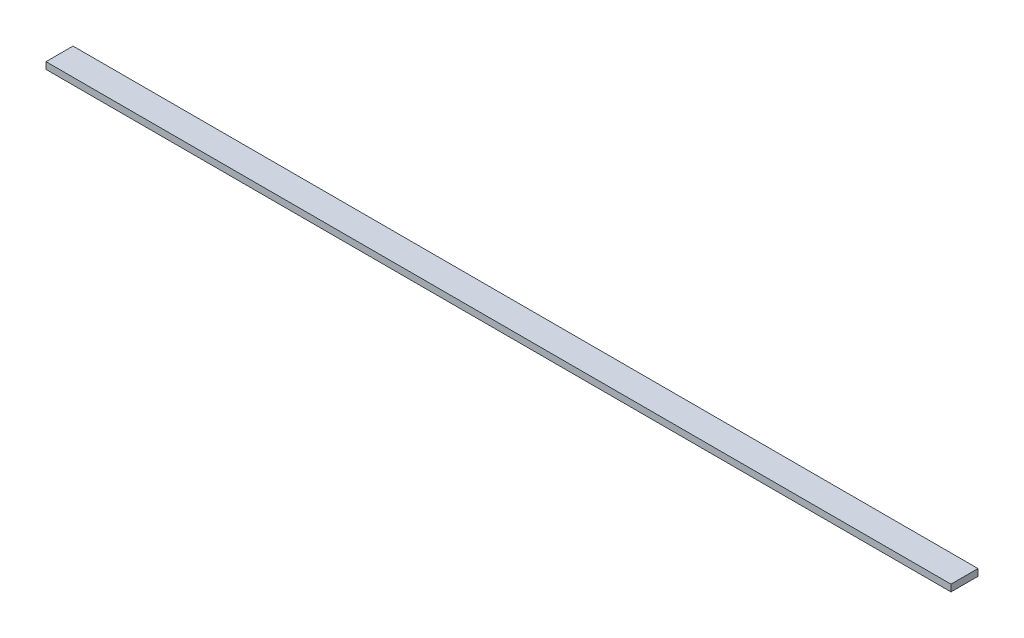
from build123d import *

# Parameters (mm, degrees)
SKETCH1_W           = 850.9
SKETCH1_H           = 25.4
BOSS_EXTRUDE1_DEPTH = 6.35


with BuildPart() as part:
    # Sketch1 → Boss-Extrude1 (new body)
    with BuildSketch(Plane(origin=(0, 0, 0), x_dir=(1, 0, 0), z_dir=(0, 1, 0))):
        Rectangle(SKETCH1_W, SKETCH1_H)
    extrude(amount=BOSS_EXTRUDE1_DEPTH)


solid = part.part
